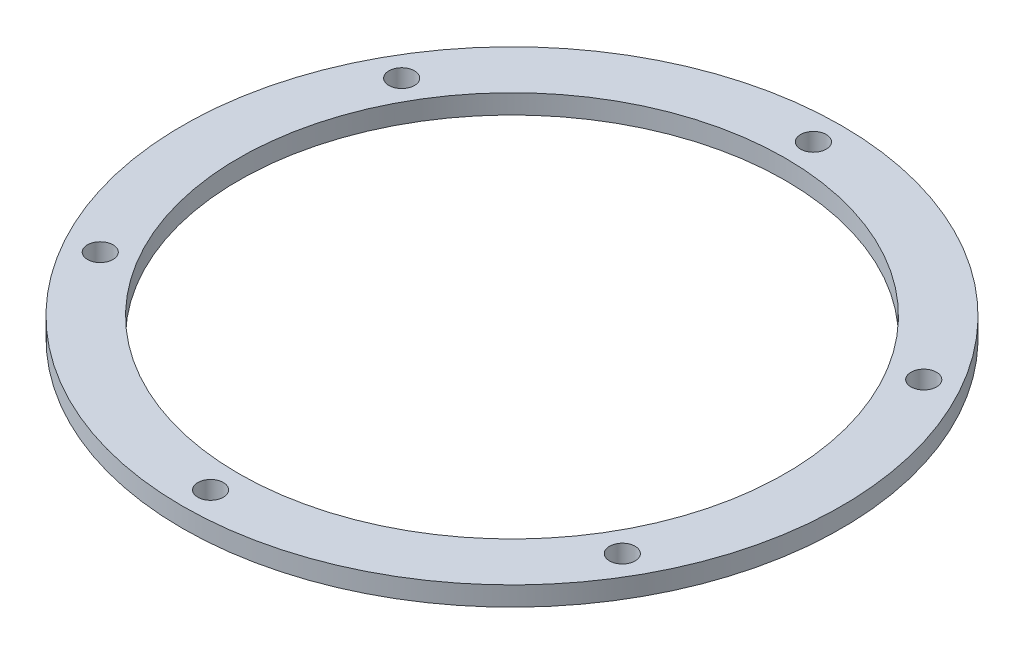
from build123d import *

# Parameters (mm, degrees)
SKETCH13_R        = 52.07
SKETCH13_R_2      = 43.18
RING_DEPTH        = 3.048
SKETCH15_R        = 2.0193
HOLES_DEPTH       = 74.701154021
CIRPATTERN1_COUNT = 6


with BuildPart() as part:
    # Sketch13 → Ring (new body)
    with BuildSketch(Plane(origin=(0, 0, 0), x_dir=(1, 0, 0), z_dir=(0, 1, 0))):
        with Locations(Location((0, 0, 0), (0, 0, 90))):
            Circle(SKETCH13_R)
        with Locations(Location((0, 0, 0), (0, 0, 90))):
            Circle(SKETCH13_R_2, mode=Mode.SUBTRACT)
    extrude(amount=RING_DEPTH)

    # Sketch15 → Holes (cut, symmetric)
    with BuildSketch(Plane(origin=(0, 3.048, 0), x_dir=(1, 0, 0), z_dir=(0, 1, 0))):
        with Locations(Location((0, 47.625, 0), (0, 0, 270))):
            Circle(SKETCH15_R)
    holes = extrude(amount=HOLES_DEPTH, both=True, mode=Mode.SUBTRACT)

    # CirPattern1: Holes ×6 about axis
    cirpattern1_axis = Axis((0, 0, 0), (0, 1, 0))
    for i in range(1, CIRPATTERN1_COUNT):
        add(holes.rotate(cirpattern1_axis, i * 360 / CIRPATTERN1_COUNT), mode=Mode.SUBTRACT)


solid = part.part
